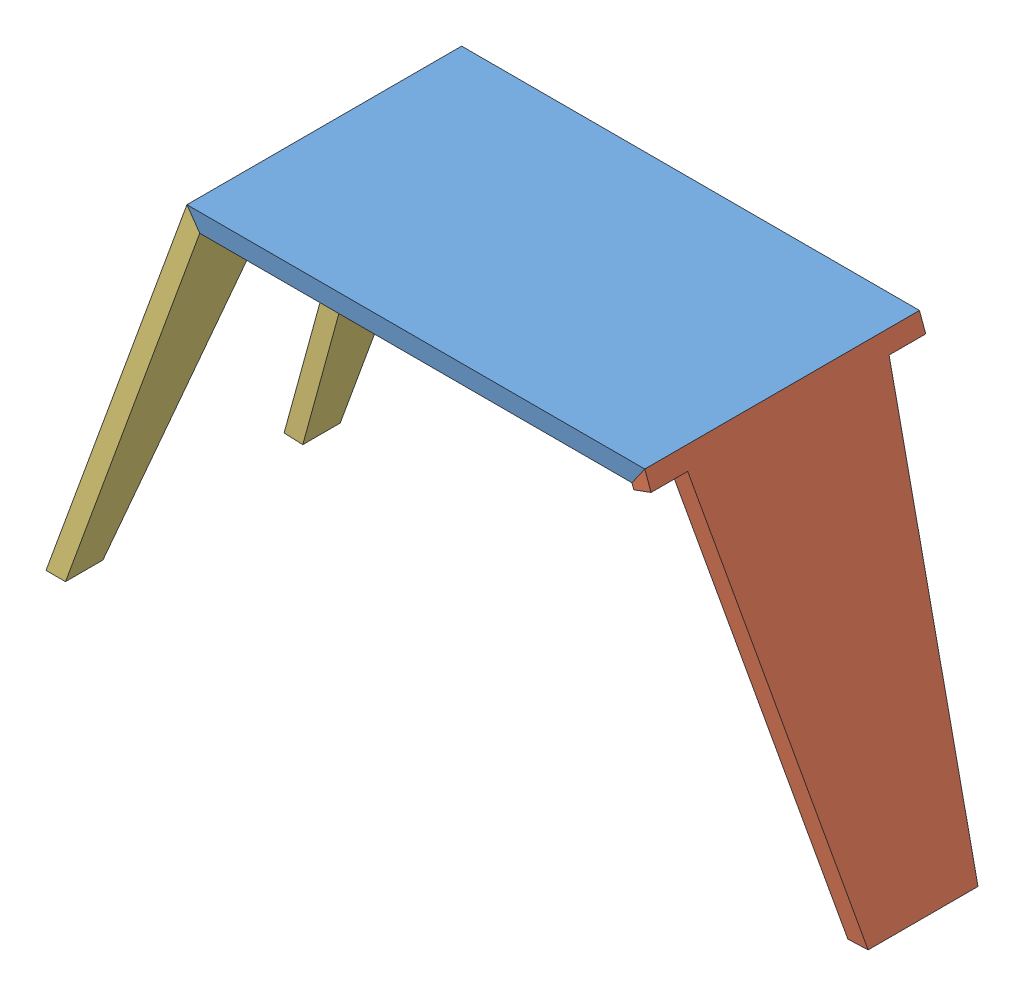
SolidWorks assembly Tabouret pliant - Bois.SLDASM, configuration 3.Dépliée (file format 5000). Lengths in mm.
Overall size (807.82 429.7 300).
3 component instances, 3 part files, 8 mates.
Components (placement in the parent):
- Plateau table-1: Plateau table.SLDPRT [Défaut] at origin size (500 20 300)
- Pied droit table-1: Pied droit table.SLDPRT [Défaut] at (394.5121 -416.2819 60) x (0 0 -1) z (0.939693 0.34202 0) size (300 450 20)
- Pied gauche table-1: Pied gauche table.SLDPRT [Défaut] at (-240.6031 6.5798 -150) x (0 0 1) z (-0.939693 0.34202 0) size (300 450 20)
Mates (geometry in assembly coordinates):
- Coïncidente1: coincident anti-aligned: line of Plateau table-1 through (235.9958 -10 -150) axis (0 0 1); line of Pied droit table-1 through (235.9958 -10 150) axis (0 0 -1)
- Coïncidente2: coincident aligned: plane of Plateau table-1 through (-250 10 150) normal (0 0 1); plane of Pied droit table-1 through (250 10 150) normal (0 0 1)
- Coïncidente3: coincident anti-aligned: plane of Plateau table-1 through (250 10 -150.001) normal (0.819152 -0.573576 0); plane of Pied droit table-1 through (250 10 150.001) normal (-0.819152 0.573576 0)
- Coïncidente4: coincident aligned: line of Plateau table-1 through (-235.9958 -10 -150) axis (0 0 1); line of Pied gauche table-1 through (-235.9958 -10 -150) axis (0 0 1)
- Coïncidente5: coincident aligned: plane of Plateau table-1 through (-250 10 -150) normal (0 0 -1); plane of Pied gauche table-1 through (-403.9091 -412.8617 -150) normal (0 0 -1)
- Coïncidente6: coincident anti-aligned: plane of Plateau table-1 through (-250 10 -150.001) normal (-0.819152 -0.573576 0); plane of Pied gauche table-1 through (-250 10 -150) normal (0.819152 0.573576 0)
- Angle1: planar angle = 3.124139 rad aligned: plane of Plateau table-1 through (0 -10 0) normal (0 -1 0); plane of Pied gauche table-1 through (-249.9979 -9.7556 -150) normal (0.017452 0.999848 0)
- Angle2: planar angle = 3.124139 rad aligned: plane of Pied droit table-1 through (-199.9336 -17.6092 60) normal (-0.017452 0.999848 0); plane of Plateau table-1 through (0 -10 0) normal (0 -1 0)
